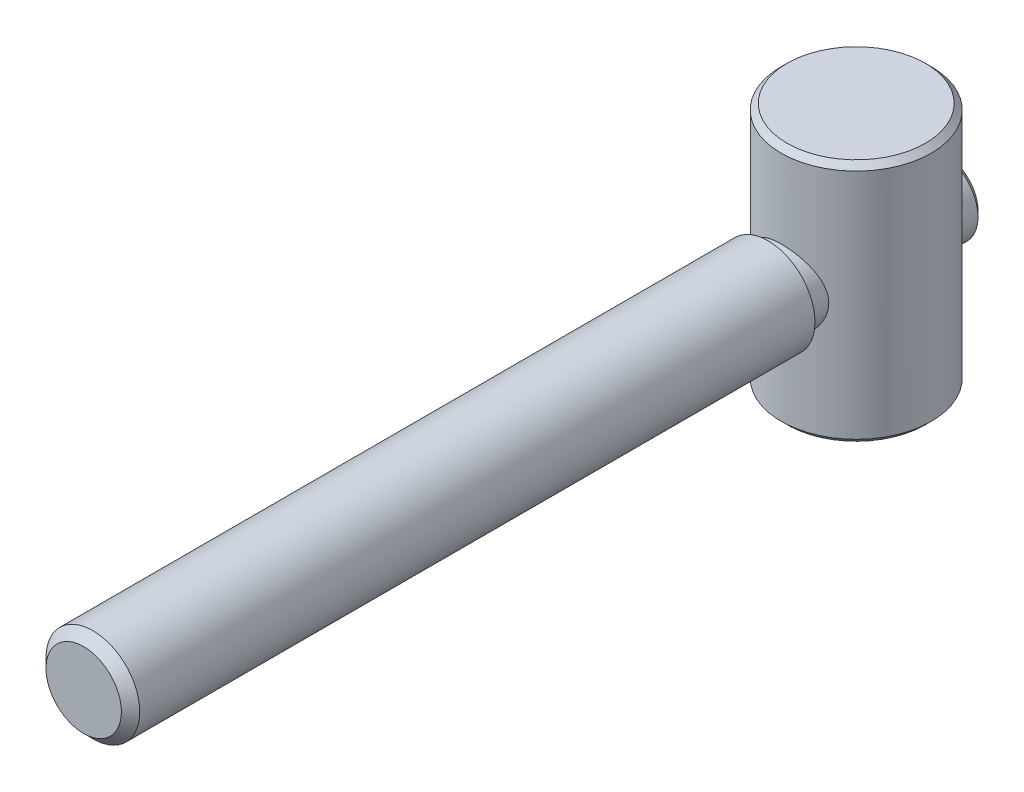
ISO-10303-21;
HEADER;
FILE_DESCRIPTION(('STEP AP214'),'2;1');
FILE_NAME('part.step','',(''),(''),'','','');
FILE_SCHEMA(('AUTOMOTIVE_DESIGN { 1 0 10303 214 1 1 1 1 }'));
ENDSEC;
DATA;
#1=APPLICATION_CONTEXT('core data for automotive mechanical design processes');
#2=APPLICATION_PROTOCOL_DEFINITION('international standard','automotive_design',2000,#1);
#3=PRODUCT_CONTEXT('',#1,'mechanical');
#4=PRODUCT('Part','Part','',(#3));
#5=PRODUCT_RELATED_PRODUCT_CATEGORY('part','',(#4));
#6=PRODUCT_DEFINITION_FORMATION('','',#4);
#7=PRODUCT_DEFINITION_CONTEXT('part definition',#1,'design');
#8=PRODUCT_DEFINITION('design','',#6,#7);
#9=PRODUCT_DEFINITION_SHAPE('','',#8);
#10=(LENGTH_UNIT() NAMED_UNIT(*) SI_UNIT(.MILLI.,.METRE.));
#11=(NAMED_UNIT(*) PLANE_ANGLE_UNIT() SI_UNIT($,.RADIAN.));
#12=(NAMED_UNIT(*) SI_UNIT($,.STERADIAN.) SOLID_ANGLE_UNIT());
#13=UNCERTAINTY_MEASURE_WITH_UNIT(LENGTH_MEASURE(1.E-05),#10,'distance_accuracy_value','');
#14=(GEOMETRIC_REPRESENTATION_CONTEXT(3) GLOBAL_UNCERTAINTY_ASSIGNED_CONTEXT((#13)) GLOBAL_UNIT_ASSIGNED_CONTEXT((#10,
#11,#12)) REPRESENTATION_CONTEXT('',''));
#15=CARTESIAN_POINT('',(0.,0.,0.));
#16=DIRECTION('',(0.,0.,1.));
#17=DIRECTION('',(1.,0.,0.));
#18=AXIS2_PLACEMENT_3D('',#15,#16,#17);
#19=CARTESIAN_POINT('',(-0.4,0.,-46.2));
#20=DIRECTION('',(1.,0.,0.));
#21=DIRECTION('',(0.,-1.,0.));
#22=AXIS2_PLACEMENT_3D('',#19,#20,#21);
#23=CYLINDRICAL_SURFACE('',#22,31.5);
#24=CARTESIAN_POINT('',(-0.4,0.,-46.2));
#25=DIRECTION('',(-1.,0.,0.));
#26=DIRECTION('',(0.,1.,0.));
#27=AXIS2_PLACEMENT_3D('',#24,#25,#26);
#28=CIRCLE('',#27,31.5);
#29=CARTESIAN_POINT('',(-0.4,-1.95959179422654,-14.7610114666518));
#30=VERTEX_POINT('',#29);
#31=CARTESIAN_POINT('',(-0.4,1.95959179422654,-14.7610114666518));
#32=VERTEX_POINT('',#31);
#33=EDGE_CURVE('E118',#30,#32,#28,.T.);
#34=ORIENTED_EDGE('',*,*,#33,.T.);
#35=CARTESIAN_POINT('',(-0.4,1.95959179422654,-14.7610114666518));
#36=CARTESIAN_POINT('',(-0.344561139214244,1.97091486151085,-14.7617184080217));
#37=CARTESIAN_POINT('',(-0.28863792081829,1.97987306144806,-14.762281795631));
#38=CARTESIAN_POINT('',(-0.176213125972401,1.99302430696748,-14.7631121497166));
#39=CARTESIAN_POINT('',(-0.119711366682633,1.99721579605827,-14.7633790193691));
#40=CARTESIAN_POINT('',(-0.00749894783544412,2.0007609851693,-14.7636046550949));
#41=CARTESIAN_POINT('',(0.0482092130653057,2.00019410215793,-14.7635684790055));
#42=CARTESIAN_POINT('',(0.159360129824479,1.99441663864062,-14.7632012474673));
#43=CARTESIAN_POINT('',(0.214802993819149,1.98920814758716,-14.7628703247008));
#44=CARTESIAN_POINT('',(0.313516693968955,1.97576492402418,-14.762023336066));
#45=CARTESIAN_POINT('',(0.356906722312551,1.96839158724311,-14.761560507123));
#46=CARTESIAN_POINT('',(0.4,1.95959179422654,-14.7610114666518));
#47=B_SPLINE_CURVE_WITH_KNOTS('',3,(#35,#36,#37,#38,#39,#40,#41,#42,#43,#44,#45,#46),
.UNSPECIFIED.,.F.,.F.,(4,2,2,2,2,4),(0.,0.169712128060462,0.33947965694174,0.506419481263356,
0.673284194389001,0.805229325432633),.UNSPECIFIED.);
#48=CARTESIAN_POINT('',(0.4,1.95959179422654,-14.7610114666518));
#49=VERTEX_POINT('',#48);
#50=EDGE_CURVE('E208',#32,#49,#47,.T.);
#51=ORIENTED_EDGE('',*,*,#50,.T.);
#52=CARTESIAN_POINT('',(0.4,0.,-46.2));
#53=DIRECTION('',(-1.,0.,0.));
#54=DIRECTION('',(0.,1.,0.));
#55=AXIS2_PLACEMENT_3D('',#52,#53,#54);
#56=CIRCLE('',#55,31.5);
#57=CARTESIAN_POINT('',(0.4,-1.95959179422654,-14.7610114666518));
#58=VERTEX_POINT('',#57);
#59=EDGE_CURVE('E105',#58,#49,#56,.T.);
#60=ORIENTED_EDGE('',*,*,#59,.F.);
#61=CARTESIAN_POINT('',(0.4,-1.95959179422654,-14.7610114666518));
#62=CARTESIAN_POINT('',(0.344561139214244,-1.97091486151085,-14.7617184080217));
#63=CARTESIAN_POINT('',(0.28863792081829,-1.97987306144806,-14.762281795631));
#64=CARTESIAN_POINT('',(0.176213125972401,-1.99302430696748,-14.7631121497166));
#65=CARTESIAN_POINT('',(0.119711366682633,-1.99721579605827,-14.7633790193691));
#66=CARTESIAN_POINT('',(0.00749894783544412,-2.0007609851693,-14.7636046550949));
#67=CARTESIAN_POINT('',(-0.0482092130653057,-2.00019410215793,-14.7635684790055));
#68=CARTESIAN_POINT('',(-0.159360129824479,-1.99441663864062,-14.7632012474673));
#69=CARTESIAN_POINT('',(-0.214802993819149,-1.98920814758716,-14.7628703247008));
#70=CARTESIAN_POINT('',(-0.313516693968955,-1.97576492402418,-14.762023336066));
#71=CARTESIAN_POINT('',(-0.356906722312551,-1.96839158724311,-14.761560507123));
#72=CARTESIAN_POINT('',(-0.4,-1.95959179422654,-14.7610114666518));
#73=B_SPLINE_CURVE_WITH_KNOTS('',3,(#61,#62,#63,#64,#65,#66,#67,#68,#69,#70,#71,#72),
.UNSPECIFIED.,.F.,.F.,(4,2,2,2,2,4),(0.,0.169712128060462,0.33947965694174,0.506419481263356,
0.673284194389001,0.805229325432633),.UNSPECIFIED.);
#74=EDGE_CURVE('E120',#58,#30,#73,.T.);
#75=ORIENTED_EDGE('',*,*,#74,.T.);
#76=EDGE_LOOP('',(#34,#51,#60,#75));
#77=FACE_BOUND('',#76,.T.);
#78=ADVANCED_FACE('F19',(#77),#23,.F.);
#79=CARTESIAN_POINT('',(0.,0.,-6.7));
#80=DIRECTION('',(0.,0.,1.));
#81=DIRECTION('',(1.,0.,0.));
#82=AXIS2_PLACEMENT_3D('',#79,#80,#81);
#83=CYLINDRICAL_SURFACE('',#82,2.);
#84=DIRECTION('',(0.,0.,1.));
#85=VECTOR('',#84,1.);
#86=CARTESIAN_POINT('',(0.4,-1.95959179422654,-16.2));
#87=LINE('',#86,#85);
#88=CARTESIAN_POINT('',(0.4,-1.95959179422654,-15.8935));
#89=VERTEX_POINT('',#88);
#90=CARTESIAN_POINT('',(0.4,-1.95959179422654,-15.3799497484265));
#91=VERTEX_POINT('',#90);
#92=EDGE_CURVE('E315',#89,#91,#87,.T.);
#93=ORIENTED_EDGE('',*,*,#92,.F.);
#94=CARTESIAN_POINT('',(0.,0.,-15.8935));
#95=DIRECTION('',(0.,0.,1.));
#96=DIRECTION('',(1.,0.,0.));
#97=AXIS2_PLACEMENT_3D('',#94,#95,#96);
#98=CIRCLE('',#97,2.);
#99=CARTESIAN_POINT('',(0.4,1.95959179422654,-15.8935));
#100=VERTEX_POINT('',#99);
#101=EDGE_CURVE('E589',#89,#100,#98,.T.);
#102=ORIENTED_EDGE('',*,*,#101,.T.);
#103=DIRECTION('',(0.,0.,1.));
#104=VECTOR('',#103,1.);
#105=CARTESIAN_POINT('',(0.4,1.95959179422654,-16.2));
#106=LINE('',#105,#104);
#107=CARTESIAN_POINT('',(0.4,1.95959179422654,-15.3799497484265));
#108=VERTEX_POINT('',#107);
#109=EDGE_CURVE('E313',#100,#108,#106,.T.);
#110=ORIENTED_EDGE('',*,*,#109,.T.);
#111=CARTESIAN_POINT('',(2.,0.,-14.8641016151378));
#112=CARTESIAN_POINT('',(1.99999158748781,0.104213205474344,-14.8641118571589));
#113=CARTESIAN_POINT('',(1.99179963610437,0.208562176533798,-14.8688763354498));
#114=CARTESIAN_POINT('',(1.95944672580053,0.414055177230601,-14.8872470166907));
#115=CARTESIAN_POINT('',(1.93525221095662,0.515192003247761,-14.9008717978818));
#116=CARTESIAN_POINT('',(1.8721998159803,0.710903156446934,-14.9349870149));
#117=CARTESIAN_POINT('',(1.83341988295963,0.80550925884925,-14.9554408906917));
#118=CARTESIAN_POINT('',(1.74253507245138,0.986848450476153,-15.0008532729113));
#119=CARTESIAN_POINT('',(1.69042947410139,1.07358111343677,-15.0258120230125));
#120=CARTESIAN_POINT('',(1.569333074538,1.24461144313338,-15.0799373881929));
#121=CARTESIAN_POINT('',(1.49930407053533,1.32811826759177,-15.109281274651));
#122=CARTESIAN_POINT('',(1.34650761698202,1.4828167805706,-15.1674396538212));
#123=CARTESIAN_POINT('',(1.26373385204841,1.55400232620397,-15.1962538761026));
#124=CARTESIAN_POINT('',(1.08097912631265,1.6867343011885,-15.2524295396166));
#125=CARTESIAN_POINT('',(0.980214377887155,1.74730753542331,-15.2795621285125));
#126=CARTESIAN_POINT('',(0.768314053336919,1.85028170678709,-15.3270151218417));
#127=CARTESIAN_POINT('',(0.657185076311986,1.8926941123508,-15.3473398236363));
#128=CARTESIAN_POINT('',(0.436089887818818,1.95500932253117,-15.3776092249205));
#129=CARTESIAN_POINT('',(0.326603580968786,1.9762990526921,-15.3881896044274));
#130=CARTESIAN_POINT('',(0.105141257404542,2.00033223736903,-15.4001516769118));
#131=CARTESIAN_POINT('',(-0.00683321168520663,2.00308691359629,-15.4015389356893));
#132=CARTESIAN_POINT('',(-0.219665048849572,1.99050665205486,-15.3952596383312));
#133=CARTESIAN_POINT('',(-0.320642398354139,1.97672396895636,-15.3883699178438));
#134=CARTESIAN_POINT('',(-0.518627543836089,1.93423831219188,-15.3674849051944));
#135=CARTESIAN_POINT('',(-0.615635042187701,1.90553422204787,-15.3534890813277));
#136=CARTESIAN_POINT('',(-0.804618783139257,1.83383486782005,-15.3194316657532));
#137=CARTESIAN_POINT('',(-0.896506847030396,1.79064737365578,-15.299288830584));
#138=CARTESIAN_POINT('',(-1.07195360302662,1.6914731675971,-15.2547529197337));
#139=CARTESIAN_POINT('',(-1.15550929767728,1.63548187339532,-15.2303583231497));
#140=CARTESIAN_POINT('',(-1.3203473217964,1.50620929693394,-15.1768878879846));
#141=CARTESIAN_POINT('',(-1.40066815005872,1.43179394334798,-15.1475875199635));
#142=CARTESIAN_POINT('',(-1.54820874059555,1.27082055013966,-15.0890868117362));
#143=CARTESIAN_POINT('',(-1.61541842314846,1.18425325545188,-15.0598865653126));
#144=CARTESIAN_POINT('',(-1.73901066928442,0.994703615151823,-15.0028831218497));
#145=CARTESIAN_POINT('',(-1.7944346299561,0.89102795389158,-14.9752863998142));
#146=CARTESIAN_POINT('',(-1.88663822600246,0.674124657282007,-14.9275090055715));
#147=CARTESIAN_POINT('',(-1.92343731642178,0.560907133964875,-14.9073206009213));
#148=CARTESIAN_POINT('',(-1.97436042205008,0.337570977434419,-14.8788927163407));
#149=CARTESIAN_POINT('',(-1.99005024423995,0.227917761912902,-14.8698331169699));
#150=CARTESIAN_POINT('',(-2.00303389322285,0.00719731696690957,-14.8623583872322));
#151=CARTESIAN_POINT('',(-2.00034071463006,-0.103868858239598,-14.8639357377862));
#152=CARTESIAN_POINT('',(-1.97807208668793,-0.311307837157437,-14.8766867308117));
#153=CARTESIAN_POINT('',(-1.96037563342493,-0.407958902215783,-14.8867917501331));
#154=CARTESIAN_POINT('',(-1.91139256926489,-0.596735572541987,-14.9138804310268));
#155=CARTESIAN_POINT('',(-1.88010155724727,-0.688859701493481,-14.9308663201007));
#156=CARTESIAN_POINT('',(-1.80329517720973,-0.870822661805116,-14.9707244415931));
#157=CARTESIAN_POINT('',(-1.7571881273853,-0.960358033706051,-14.9938328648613));
#158=CARTESIAN_POINT('',(-1.65257412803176,-1.13093854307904,-15.043122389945));
#159=CARTESIAN_POINT('',(-1.59406080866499,-1.21197928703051,-15.069305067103));
#160=CARTESIAN_POINT('',(-1.45767433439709,-1.37395753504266,-15.1257599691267));
#161=CARTESIAN_POINT('',(-1.37829054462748,-1.45359430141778,-15.1561316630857));
#162=CARTESIAN_POINT('',(-1.20680899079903,-1.59882447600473,-15.214684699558));
#163=CARTESIAN_POINT('',(-1.11470694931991,-1.66441314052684,-15.2428653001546));
#164=CARTESIAN_POINT('',(-0.917070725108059,-1.78114745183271,-15.2948272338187));
#165=CARTESIAN_POINT('',(-0.811246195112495,-1.83186623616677,-15.3184728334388));
#166=CARTESIAN_POINT('',(-0.591044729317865,-1.91427580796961,-15.3576670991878));
#167=CARTESIAN_POINT('',(-0.476675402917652,-1.9459833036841,-15.373222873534));
#168=CARTESIAN_POINT('',(-0.253959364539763,-1.98673712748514,-15.3933501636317));
#169=CARTESIAN_POINT('',(-0.1460228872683,-1.99759574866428,-15.3987985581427));
#170=CARTESIAN_POINT('',(0.0702519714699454,-2.00168653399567,-15.4008426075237));
#171=CARTESIAN_POINT('',(0.178590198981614,-1.99492486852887,-15.3974413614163));
#172=CARTESIAN_POINT('',(0.385075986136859,-1.96516717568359,-15.3826793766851));
#173=CARTESIAN_POINT('',(0.483424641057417,-1.94327026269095,-15.3718578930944));
#174=CARTESIAN_POINT('',(0.674891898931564,-1.88534604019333,-15.3438418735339));
#175=CARTESIAN_POINT('',(0.768009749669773,-1.84931670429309,-15.3266464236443));
#176=CARTESIAN_POINT('',(0.95084683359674,-1.7625457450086,-15.2865186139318));
#177=CARTESIAN_POINT('',(1.04025036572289,-1.71124078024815,-15.263372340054));
#178=CARTESIAN_POINT('',(1.20954920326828,-1.59608471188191,-15.2137626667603));
#179=CARTESIAN_POINT('',(1.28944011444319,-1.53222784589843,-15.1872977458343));
#180=CARTESIAN_POINT('',(1.44582833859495,-1.38640336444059,-15.1305721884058));
#181=CARTESIAN_POINT('',(1.52119665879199,-1.30326581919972,-15.1001959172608));
#182=CARTESIAN_POINT('',(1.65732528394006,-1.12510777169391,-15.0412615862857));
#183=CARTESIAN_POINT('',(1.71807266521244,-1.03007686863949,-15.0127051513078));
#184=CARTESIAN_POINT('',(1.82486714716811,-0.826691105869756,-14.9599918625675));
#185=CARTESIAN_POINT('',(1.87038902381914,-0.718010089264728,-14.9360025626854));
#186=CARTESIAN_POINT('',(1.92395929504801,-0.549421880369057,-14.9069621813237));
#187=CARTESIAN_POINT('',(1.93935666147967,-0.492352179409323,-14.898443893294));
#188=CARTESIAN_POINT('',(1.96508069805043,-0.376767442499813,-14.8840605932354));
#189=CARTESIAN_POINT('',(1.97541091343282,-0.318253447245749,-14.8781937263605));
#190=CARTESIAN_POINT('',(1.9887293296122,-0.21639921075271,-14.8705902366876));
#191=CARTESIAN_POINT('',(1.99295091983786,-0.173266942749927,-14.8681638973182));
#192=CARTESIAN_POINT('',(1.99858810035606,-0.0867643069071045,-14.8649174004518));
#193=CARTESIAN_POINT('',(2.00000350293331,-0.0433939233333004,-14.8640973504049));
#194=CARTESIAN_POINT('',(2.,0.,-14.8641016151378));
#195=B_SPLINE_CURVE_WITH_KNOTS('',3,(#111,#112,#113,#114,#115,#116,#117,#118,#119,#120,#121,
#122,#123,#124,#125,#126,#127,#128,#129,#130,#131,#132,#133,#134,#135,#136,#137,#138,#139,#140,
#141,#142,#143,#144,#145,#146,#147,#148,#149,#150,#151,#152,#153,#154,#155,#156,#157,#158,#159,
#160,#161,#162,#163,#164,#165,#166,#167,#168,#169,#170,#171,#172,#173,#174,#175,#176,#177,#178,
#179,#180,#181,#182,#183,#184,#185,#186,#187,#188,#189,#190,#191,#192,#193,#194),.UNSPECIFIED.,
.T.,.F.,(4,2,2,2,2,2,2,2,2,2,2,2,2,2,2,2,2,2,2,2,2,2,2,2,2,2,2,2,2,2,2,2,2,2,2,2,2,2,2,2,2,4),
(0.,0.312464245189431,0.625585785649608,0.937057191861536,1.24854545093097,1.58572462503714,
1.92307142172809,2.28315784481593,2.64301653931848,2.97726969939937,3.31132047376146,
3.61632194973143,3.92134625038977,4.2305906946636,4.5399459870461,4.87854382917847,
5.21740096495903,5.57777683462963,5.93777548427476,6.2692458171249,6.60048186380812,
6.89548366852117,7.19058104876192,7.49934592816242,7.80826972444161,8.15613487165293,
8.50411729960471,8.86128362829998,9.21813559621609,9.5422454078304,9.8662417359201,
10.1688884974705,10.4715786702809,10.7872150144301,11.102996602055,11.450204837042,
11.7977188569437,12.1562149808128,12.3351395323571,12.5139387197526,12.6440387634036,
12.7741475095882),.UNSPECIFIED.);
#196=EDGE_CURVE('E113',#91,#108,#195,.T.);
#197=ORIENTED_EDGE('',*,*,#196,.F.);
#198=EDGE_LOOP('',(#93,#102,#110,#197));
#199=FACE_BOUND('',#198,.T.);
#200=ADVANCED_FACE('F222',(#199),#83,.T.);
#201=CARTESIAN_POINT('',(0.4,0.,-46.2));
#202=DIRECTION('',(-1.,0.,0.));
#203=DIRECTION('',(0.,1.,0.));
#204=AXIS2_PLACEMENT_3D('',#201,#202,#203);
#205=PLANE('',#204);
#206=DIRECTION('',(0.,1.,0.));
#207=VECTOR('',#206,1.);
#208=CARTESIAN_POINT('',(0.4,1.95959179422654,-16.2));
#209=LINE('',#208,#207);
#210=CARTESIAN_POINT('',(0.4,-1.64558264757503,-16.2));
#211=VERTEX_POINT('',#210);
#212=CARTESIAN_POINT('',(0.4,1.64558264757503,-16.2));
#213=VERTEX_POINT('',#212);
#214=EDGE_CURVE('E309',#211,#213,#209,.T.);
#215=ORIENTED_EDGE('',*,*,#214,.F.);
#216=CARTESIAN_POINT('',(0.4,-1.64558264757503,-16.2));
#217=CARTESIAN_POINT('',(0.4,-1.69802260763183,-16.149024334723));
#218=CARTESIAN_POINT('',(0.4,-1.75041001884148,-16.0979948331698));
#219=CARTESIAN_POINT('',(0.4,-1.85507973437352,-15.9958281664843));
#220=CARTESIAN_POINT('',(0.4,-1.90736203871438,-15.9446910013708));
#221=CARTESIAN_POINT('',(0.4,-1.95959179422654,-15.8935));
#222=B_SPLINE_CURVE_WITH_KNOTS('',3,(#216,#217,#218,#219,#220,#221),.UNSPECIFIED.,.F.,.F.,(4,2,
4),(0.,0.219399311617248,0.438798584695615),.UNSPECIFIED.);
#223=EDGE_CURVE('E249',#211,#89,#222,.T.);
#224=ORIENTED_EDGE('',*,*,#223,.T.);
#225=ORIENTED_EDGE('',*,*,#92,.T.);
#226=DIRECTION('',(0.,0.,1.));
#227=VECTOR('',#226,1.);
#228=CARTESIAN_POINT('',(0.4,-1.95959179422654,-6.7));
#229=LINE('',#228,#227);
#230=EDGE_CURVE('E101',#91,#58,#229,.T.);
#231=ORIENTED_EDGE('',*,*,#230,.T.);
#232=ORIENTED_EDGE('',*,*,#59,.T.);
#233=DIRECTION('',(0.,0.,1.));
#234=VECTOR('',#233,1.);
#235=CARTESIAN_POINT('',(0.4,1.95959179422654,-6.7));
#236=LINE('',#235,#234);
#237=EDGE_CURVE('E197',#49,#108,#236,.F.);
#238=ORIENTED_EDGE('',*,*,#237,.T.);
#239=ORIENTED_EDGE('',*,*,#109,.F.);
#240=CARTESIAN_POINT('',(0.4,1.95959179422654,-15.8935));
#241=CARTESIAN_POINT('',(0.4,1.90736203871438,-15.9446910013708));
#242=CARTESIAN_POINT('',(0.4,1.85507973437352,-15.9958281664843));
#243=CARTESIAN_POINT('',(0.4,1.75041001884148,-16.0979948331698));
#244=CARTESIAN_POINT('',(0.4,1.69802260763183,-16.149024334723));
#245=CARTESIAN_POINT('',(0.4,1.64558264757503,-16.2));
#246=B_SPLINE_CURVE_WITH_KNOTS('',3,(#240,#241,#242,#243,#244,#245),.UNSPECIFIED.,.F.,.F.,(4,2,
4),(0.,0.219399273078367,0.438798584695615),.UNSPECIFIED.);
#247=EDGE_CURVE('E242',#100,#213,#246,.T.);
#248=ORIENTED_EDGE('',*,*,#247,.T.);
#249=EDGE_LOOP('',(#215,#224,#225,#231,#232,#238,#239,#248));
#250=FACE_BOUND('',#249,.T.);
#251=ADVANCED_FACE('F224',(#250),#205,.T.);
#252=DIRECTION('',(0.,0.,1.));
#253=VECTOR('',#252,1.);
#254=CARTESIAN_POINT('',(-0.4,1.95959179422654,-16.2));
#255=LINE('',#254,#253);
#256=CARTESIAN_POINT('',(-0.4,1.95959179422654,-15.8935));
#257=VERTEX_POINT('',#256);
#258=CARTESIAN_POINT('',(-0.4,1.95959179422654,-15.3799497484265));
#259=VERTEX_POINT('',#258);
#260=EDGE_CURVE('E89',#257,#259,#255,.T.);
#261=ORIENTED_EDGE('',*,*,#260,.F.);
#262=CARTESIAN_POINT('',(0.,0.,-15.8935));
#263=DIRECTION('',(0.,0.,1.));
#264=DIRECTION('',(1.,0.,0.));
#265=AXIS2_PLACEMENT_3D('',#262,#263,#264);
#266=CIRCLE('',#265,2.);
#267=CARTESIAN_POINT('',(-0.4,-1.95959179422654,-15.8935));
#268=VERTEX_POINT('',#267);
#269=EDGE_CURVE('E11',#257,#268,#266,.T.);
#270=ORIENTED_EDGE('',*,*,#269,.T.);
#271=DIRECTION('',(0.,0.,1.));
#272=VECTOR('',#271,1.);
#273=CARTESIAN_POINT('',(-0.4,-1.95959179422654,-16.2));
#274=LINE('',#273,#272);
#275=CARTESIAN_POINT('',(-0.4,-1.95959179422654,-15.3799497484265));
#276=VERTEX_POINT('',#275);
#277=EDGE_CURVE('E81',#268,#276,#274,.T.);
#278=ORIENTED_EDGE('',*,*,#277,.T.);
#279=EDGE_CURVE('E85',#259,#276,#195,.T.);
#280=ORIENTED_EDGE('',*,*,#279,.F.);
#281=EDGE_LOOP('',(#261,#270,#278,#280));
#282=FACE_BOUND('',#281,.T.);
#283=ADVANCED_FACE('F83',(#282),#83,.T.);
#284=CARTESIAN_POINT('',(-0.4,0.,-46.2));
#285=DIRECTION('',(-1.,0.,0.));
#286=DIRECTION('',(0.,1.,0.));
#287=AXIS2_PLACEMENT_3D('',#284,#285,#286);
#288=PLANE('',#287);
#289=DIRECTION('',(0.,-1.,0.));
#290=VECTOR('',#289,1.);
#291=CARTESIAN_POINT('',(-0.4,-1.95959179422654,-16.2));
#292=LINE('',#291,#290);
#293=CARTESIAN_POINT('',(-0.4,1.64558264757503,-16.2));
#294=VERTEX_POINT('',#293);
#295=CARTESIAN_POINT('',(-0.4,-1.64558264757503,-16.2));
#296=VERTEX_POINT('',#295);
#297=EDGE_CURVE('E90',#294,#296,#292,.T.);
#298=ORIENTED_EDGE('',*,*,#297,.F.);
#299=CARTESIAN_POINT('',(-0.4,1.64558264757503,-16.2));
#300=CARTESIAN_POINT('',(-0.4,1.69802260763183,-16.149024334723));
#301=CARTESIAN_POINT('',(-0.4,1.75041001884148,-16.0979948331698));
#302=CARTESIAN_POINT('',(-0.4,1.85507973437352,-15.9958281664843));
#303=CARTESIAN_POINT('',(-0.4,1.90736203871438,-15.9446910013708));
#304=CARTESIAN_POINT('',(-0.4,1.95959179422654,-15.8935));
#305=B_SPLINE_CURVE_WITH_KNOTS('',3,(#299,#300,#301,#302,#303,#304),.UNSPECIFIED.,.F.,.F.,(4,2,
4),(0.,0.219399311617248,0.438798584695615),.UNSPECIFIED.);
#306=EDGE_CURVE('E29',#294,#257,#305,.T.);
#307=ORIENTED_EDGE('',*,*,#306,.T.);
#308=ORIENTED_EDGE('',*,*,#260,.T.);
#309=DIRECTION('',(0.,0.,1.));
#310=VECTOR('',#309,1.);
#311=CARTESIAN_POINT('',(-0.4,1.95959179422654,-6.7));
#312=LINE('',#311,#310);
#313=EDGE_CURVE('E164',#32,#259,#312,.F.);
#314=ORIENTED_EDGE('',*,*,#313,.F.);
#315=ORIENTED_EDGE('',*,*,#33,.F.);
#316=DIRECTION('',(0.,0.,1.));
#317=VECTOR('',#316,1.);
#318=CARTESIAN_POINT('',(-0.4,-1.95959179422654,-6.7));
#319=LINE('',#318,#317);
#320=EDGE_CURVE('E99',#276,#30,#319,.T.);
#321=ORIENTED_EDGE('',*,*,#320,.F.);
#322=ORIENTED_EDGE('',*,*,#277,.F.);
#323=CARTESIAN_POINT('',(-0.4,-1.95959179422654,-15.8935));
#324=CARTESIAN_POINT('',(-0.4,-1.90736203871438,-15.9446910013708));
#325=CARTESIAN_POINT('',(-0.4,-1.85507973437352,-15.9958281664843));
#326=CARTESIAN_POINT('',(-0.4,-1.75041001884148,-16.0979948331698));
#327=CARTESIAN_POINT('',(-0.4,-1.69802260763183,-16.149024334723));
#328=CARTESIAN_POINT('',(-0.4,-1.64558264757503,-16.2));
#329=B_SPLINE_CURVE_WITH_KNOTS('',3,(#323,#324,#325,#326,#327,#328),.UNSPECIFIED.,.F.,.F.,(4,2,
4),(0.,0.219399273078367,0.438798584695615),.UNSPECIFIED.);
#330=EDGE_CURVE('E576',#268,#296,#329,.T.);
#331=ORIENTED_EDGE('',*,*,#330,.T.);
#332=EDGE_LOOP('',(#298,#307,#308,#314,#315,#321,#322,#331));
#333=FACE_BOUND('',#332,.T.);
#334=ADVANCED_FACE('F115',(#333),#288,.F.);
#335=CARTESIAN_POINT('',(0.,-6.5,-11.4));
#336=DIRECTION('',(0.,-1.,0.));
#337=DIRECTION('',(-1.,0.,0.));
#338=AXIS2_PLACEMENT_3D('',#335,#336,#337);
#339=PLANE('',#338);
#340=CARTESIAN_POINT('',(0.,-6.5,-11.4));
#341=DIRECTION('',(0.,-1.,0.));
#342=DIRECTION('',(0.,0.,-1.));
#343=AXIS2_PLACEMENT_3D('',#340,#341,#342);
#344=CIRCLE('',#343,3.6935);
#345=CARTESIAN_POINT('',(0.,-6.5,-15.0935));
#346=VERTEX_POINT('',#345);
#347=EDGE_CURVE('E294',#346,#346,#344,.T.);
#348=ORIENTED_EDGE('',*,*,#347,.T.);
#349=EDGE_LOOP('',(#348));
#350=FACE_BOUND('',#349,.T.);
#351=ADVANCED_FACE('F343',(#350),#339,.T.);
#352=CARTESIAN_POINT('',(0.,6.5,-11.4));
#353=DIRECTION('',(0.,1.,0.));
#354=DIRECTION('',(1.,0.,0.));
#355=AXIS2_PLACEMENT_3D('',#352,#353,#354);
#356=PLANE('',#355);
#357=CARTESIAN_POINT('',(0.,6.5,-11.4));
#358=DIRECTION('',(0.,1.,0.));
#359=DIRECTION('',(0.,0.,1.));
#360=AXIS2_PLACEMENT_3D('',#357,#358,#359);
#361=CIRCLE('',#360,3.6935);
#362=CARTESIAN_POINT('',(0.,6.5,-7.7065));
#363=VERTEX_POINT('',#362);
#364=EDGE_CURVE('E285',#363,#363,#361,.T.);
#365=ORIENTED_EDGE('',*,*,#364,.T.);
#366=EDGE_LOOP('',(#365));
#367=FACE_BOUND('',#366,.T.);
#368=ADVANCED_FACE('F341',(#367),#356,.T.);
#369=CARTESIAN_POINT('',(0.,6.5,-11.4));
#370=DIRECTION('',(0.,1.,0.));
#371=DIRECTION('',(1.,0.,0.));
#372=AXIS2_PLACEMENT_3D('',#369,#370,#371);
#373=CYLINDRICAL_SURFACE('',#372,4.);
#374=CARTESIAN_POINT('',(0.,-6.1935,-11.4));
#375=DIRECTION('',(0.,-1.,0.));
#376=DIRECTION('',(0.,0.,-1.));
#377=AXIS2_PLACEMENT_3D('',#374,#375,#376);
#378=CIRCLE('',#377,4.);
#379=CARTESIAN_POINT('',(0.,-6.1935,-15.4));
#380=VERTEX_POINT('',#379);
#381=EDGE_CURVE('E290',#380,#380,#378,.F.);
#382=ORIENTED_EDGE('',*,*,#381,.T.);
#383=EDGE_LOOP('',(#382));
#384=FACE_BOUND('',#383,.T.);
#385=CARTESIAN_POINT('',(0.,6.1935,-11.4));
#386=DIRECTION('',(0.,1.,0.));
#387=DIRECTION('',(0.,0.,1.));
#388=AXIS2_PLACEMENT_3D('',#385,#386,#387);
#389=CIRCLE('',#388,4.);
#390=CARTESIAN_POINT('',(0.,6.1935,-7.4));
#391=VERTEX_POINT('',#390);
#392=EDGE_CURVE('E288',#391,#391,#389,.F.);
#393=ORIENTED_EDGE('',*,*,#392,.T.);
#394=EDGE_LOOP('',(#393));
#395=FACE_BOUND('',#394,.T.);
#396=CARTESIAN_POINT('',(2.,0.,-7.93589838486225));
#397=CARTESIAN_POINT('',(1.99999158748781,-0.104213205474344,-7.93588814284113));
#398=CARTESIAN_POINT('',(1.99179963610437,-0.208562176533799,-7.93112366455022));
#399=CARTESIAN_POINT('',(1.95944672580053,-0.414055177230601,-7.91275298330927));
#400=CARTESIAN_POINT('',(1.93525221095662,-0.515192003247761,-7.89912820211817));
#401=CARTESIAN_POINT('',(1.8721998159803,-0.710903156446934,-7.86501298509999));
#402=CARTESIAN_POINT('',(1.83341988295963,-0.80550925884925,-7.84455910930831));
#403=CARTESIAN_POINT('',(1.74253507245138,-0.986848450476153,-7.79914672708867));
#404=CARTESIAN_POINT('',(1.69042947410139,-1.07358111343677,-7.77418797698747));
#405=CARTESIAN_POINT('',(1.569333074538,-1.24461144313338,-7.72006261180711));
#406=CARTESIAN_POINT('',(1.49930407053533,-1.32811826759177,-7.69071872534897));
#407=CARTESIAN_POINT('',(1.34650761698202,-1.4828167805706,-7.63256034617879));
#408=CARTESIAN_POINT('',(1.26373385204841,-1.55400232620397,-7.60374612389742));
#409=CARTESIAN_POINT('',(1.08097912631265,-1.6867343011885,-7.5475704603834));
#410=CARTESIAN_POINT('',(0.980214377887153,-1.74730753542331,-7.52043787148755));
#411=CARTESIAN_POINT('',(0.768314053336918,-1.85028170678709,-7.47298487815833));
#412=CARTESIAN_POINT('',(0.657185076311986,-1.8926941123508,-7.45266017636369));
#413=CARTESIAN_POINT('',(0.436089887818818,-1.95500932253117,-7.42239077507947));
#414=CARTESIAN_POINT('',(0.326603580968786,-1.9762990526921,-7.4118103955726));
#415=CARTESIAN_POINT('',(0.105141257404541,-2.00033223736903,-7.39984832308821));
#416=CARTESIAN_POINT('',(-0.00683321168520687,-2.00308691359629,-7.39846106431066));
#417=CARTESIAN_POINT('',(-0.219665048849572,-1.99050665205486,-7.40474036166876));
#418=CARTESIAN_POINT('',(-0.320642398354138,-1.97672396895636,-7.41163008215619));
#419=CARTESIAN_POINT('',(-0.518627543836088,-1.93423831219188,-7.43251509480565));
#420=CARTESIAN_POINT('',(-0.6156350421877,-1.90553422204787,-7.44651091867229));
#421=CARTESIAN_POINT('',(-0.804618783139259,-1.83383486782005,-7.48056833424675));
#422=CARTESIAN_POINT('',(-0.896506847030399,-1.79064737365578,-7.50071116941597));
#423=CARTESIAN_POINT('',(-1.07195360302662,-1.6914731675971,-7.5452470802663));
#424=CARTESIAN_POINT('',(-1.15550929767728,-1.63548187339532,-7.56964167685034));
#425=CARTESIAN_POINT('',(-1.3203473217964,-1.50620929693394,-7.62311211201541));
#426=CARTESIAN_POINT('',(-1.40066815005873,-1.43179394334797,-7.6524124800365));
#427=CARTESIAN_POINT('',(-1.54820874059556,-1.27082055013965,-7.71091318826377));
#428=CARTESIAN_POINT('',(-1.61541842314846,-1.18425325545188,-7.74011343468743));
#429=CARTESIAN_POINT('',(-1.73901066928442,-0.994703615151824,-7.79711687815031));
#430=CARTESIAN_POINT('',(-1.7944346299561,-0.891027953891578,-7.82471360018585));
#431=CARTESIAN_POINT('',(-1.88663822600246,-0.674124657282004,-7.87249099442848));
#432=CARTESIAN_POINT('',(-1.92343731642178,-0.560907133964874,-7.89267939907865));
#433=CARTESIAN_POINT('',(-1.97436042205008,-0.33757097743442,-7.92110728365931));
#434=CARTESIAN_POINT('',(-1.99005024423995,-0.227917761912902,-7.93016688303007));
#435=CARTESIAN_POINT('',(-2.00303389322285,-0.00719731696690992,-7.93764161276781));
#436=CARTESIAN_POINT('',(-2.00034071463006,0.103868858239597,-7.93606426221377));
#437=CARTESIAN_POINT('',(-1.97807208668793,0.311307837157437,-7.9233132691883));
#438=CARTESIAN_POINT('',(-1.96037563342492,0.407958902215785,-7.91320824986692));
#439=CARTESIAN_POINT('',(-1.91139256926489,0.596735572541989,-7.88611956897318));
#440=CARTESIAN_POINT('',(-1.88010155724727,0.688859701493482,-7.86913367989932));
#441=CARTESIAN_POINT('',(-1.80329517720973,0.870822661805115,-7.82927555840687));
#442=CARTESIAN_POINT('',(-1.7571881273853,0.960358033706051,-7.80616713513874));
#443=CARTESIAN_POINT('',(-1.65257412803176,1.13093854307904,-7.756877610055));
#444=CARTESIAN_POINT('',(-1.59406080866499,1.21197928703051,-7.73069493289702));
#445=CARTESIAN_POINT('',(-1.45767433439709,1.37395753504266,-7.67424003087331));
#446=CARTESIAN_POINT('',(-1.37829054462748,1.45359430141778,-7.64386833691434));
#447=CARTESIAN_POINT('',(-1.20680899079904,1.59882447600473,-7.58531530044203));
#448=CARTESIAN_POINT('',(-1.11470694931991,1.66441314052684,-7.55713469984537));
#449=CARTESIAN_POINT('',(-0.917070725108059,1.78114745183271,-7.50517276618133));
#450=CARTESIAN_POINT('',(-0.811246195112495,1.83186623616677,-7.48152716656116));
#451=CARTESIAN_POINT('',(-0.591044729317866,1.91427580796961,-7.44233290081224));
#452=CARTESIAN_POINT('',(-0.476675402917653,1.9459833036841,-7.42677712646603));
#453=CARTESIAN_POINT('',(-0.253959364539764,1.98673712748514,-7.40664983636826));
#454=CARTESIAN_POINT('',(-0.1460228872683,1.99759574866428,-7.4012014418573));
#455=CARTESIAN_POINT('',(0.0702519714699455,2.00168653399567,-7.39915739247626));
#456=CARTESIAN_POINT('',(0.178590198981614,1.99492486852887,-7.40255863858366));
#457=CARTESIAN_POINT('',(0.385075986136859,1.96516717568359,-7.41732062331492));
#458=CARTESIAN_POINT('',(0.483424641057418,1.94327026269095,-7.42814210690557));
#459=CARTESIAN_POINT('',(0.674891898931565,1.88534604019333,-7.45615812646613));
#460=CARTESIAN_POINT('',(0.768009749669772,1.84931670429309,-7.47335357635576));
#461=CARTESIAN_POINT('',(0.950846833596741,1.7625457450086,-7.51348138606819));
#462=CARTESIAN_POINT('',(1.0402503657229,1.71124078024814,-7.53662765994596));
#463=CARTESIAN_POINT('',(1.20954920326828,1.59608471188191,-7.58623733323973));
#464=CARTESIAN_POINT('',(1.28944011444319,1.53222784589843,-7.61270225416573));
#465=CARTESIAN_POINT('',(1.44582833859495,1.38640336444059,-7.66942781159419));
#466=CARTESIAN_POINT('',(1.52119665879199,1.30326581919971,-7.69980408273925));
#467=CARTESIAN_POINT('',(1.65732528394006,1.12510777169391,-7.75873841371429));
#468=CARTESIAN_POINT('',(1.71807266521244,1.03007686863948,-7.78729484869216));
#469=CARTESIAN_POINT('',(1.82486714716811,0.826691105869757,-7.84000813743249));
#470=CARTESIAN_POINT('',(1.87038902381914,0.718010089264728,-7.86399743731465));
#471=CARTESIAN_POINT('',(1.92395929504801,0.549421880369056,-7.8930378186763));
#472=CARTESIAN_POINT('',(1.93935666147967,0.492352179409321,-7.90155610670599));
#473=CARTESIAN_POINT('',(1.96508069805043,0.376767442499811,-7.91593940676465));
#474=CARTESIAN_POINT('',(1.97541091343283,0.318253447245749,-7.9218062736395));
#475=CARTESIAN_POINT('',(1.9887293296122,0.21639921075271,-7.92940976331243));
#476=CARTESIAN_POINT('',(1.99295091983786,0.173266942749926,-7.93183610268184));
#477=CARTESIAN_POINT('',(1.99858810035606,0.086764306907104,-7.93508259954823));
#478=CARTESIAN_POINT('',(2.00000350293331,0.0433939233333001,-7.93590264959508));
#479=CARTESIAN_POINT('',(2.,0.,-7.93589838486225));
#480=B_SPLINE_CURVE_WITH_KNOTS('',3,(#396,#397,#398,#399,#400,#401,#402,#403,#404,#405,#406,
#407,#408,#409,#410,#411,#412,#413,#414,#415,#416,#417,#418,#419,#420,#421,#422,#423,#424,#425,
#426,#427,#428,#429,#430,#431,#432,#433,#434,#435,#436,#437,#438,#439,#440,#441,#442,#443,#444,
#445,#446,#447,#448,#449,#450,#451,#452,#453,#454,#455,#456,#457,#458,#459,#460,#461,#462,#463,
#464,#465,#466,#467,#468,#469,#470,#471,#472,#473,#474,#475,#476,#477,#478,#479),.UNSPECIFIED.,
.T.,.F.,(4,2,2,2,2,2,2,2,2,2,2,2,2,2,2,2,2,2,2,2,2,2,2,2,2,2,2,2,2,2,2,2,2,2,2,2,2,2,2,2,2,4),
(0.,0.312464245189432,0.62558578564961,0.937057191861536,1.24854545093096,1.58572462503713,
1.92307142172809,2.28315784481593,2.64301653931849,2.97726969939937,3.31132047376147,
3.61632194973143,3.92134625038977,4.2305906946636,4.53994598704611,4.87854382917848,
5.21740096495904,5.57777683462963,5.93777548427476,6.2692458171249,6.60048186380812,
6.89548366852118,7.19058104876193,7.49934592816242,7.80826972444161,8.15613487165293,
8.50411729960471,8.86128362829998,9.2181355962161,9.5422454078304,9.8662417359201,
10.1688884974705,10.4715786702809,10.7872150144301,11.102996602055,11.450204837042,
11.7977188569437,12.1562149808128,12.3351395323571,12.5139387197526,12.6440387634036,
12.7741475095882),.UNSPECIFIED.);
#481=CARTESIAN_POINT('',(2.,0.,-7.93589838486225));
#482=VERTEX_POINT('',#481);
#483=EDGE_CURVE('E112',#482,#482,#480,.T.);
#484=ORIENTED_EDGE('',*,*,#483,.T.);
#485=EDGE_LOOP('',(#484));
#486=FACE_BOUND('',#485,.T.);
#487=CARTESIAN_POINT('',(-2.,0.,-14.8641016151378));
#488=CARTESIAN_POINT('',(-1.99999158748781,-0.104213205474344,-14.8641118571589));
#489=CARTESIAN_POINT('',(-1.99179963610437,-0.208562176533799,-14.8688763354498));
#490=CARTESIAN_POINT('',(-1.95944672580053,-0.414055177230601,-14.8872470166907));
#491=CARTESIAN_POINT('',(-1.93525221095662,-0.515192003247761,-14.9008717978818));
#492=CARTESIAN_POINT('',(-1.8721998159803,-0.710903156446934,-14.9349870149));
#493=CARTESIAN_POINT('',(-1.83341988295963,-0.80550925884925,-14.9554408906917));
#494=CARTESIAN_POINT('',(-1.74253507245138,-0.986848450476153,-15.0008532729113));
#495=CARTESIAN_POINT('',(-1.69042947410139,-1.07358111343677,-15.0258120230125));
#496=CARTESIAN_POINT('',(-1.569333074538,-1.24461144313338,-15.0799373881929));
#497=CARTESIAN_POINT('',(-1.49930407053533,-1.32811826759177,-15.109281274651));
#498=CARTESIAN_POINT('',(-1.34650761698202,-1.4828167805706,-15.1674396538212));
#499=CARTESIAN_POINT('',(-1.26373385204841,-1.55400232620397,-15.1962538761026));
#500=CARTESIAN_POINT('',(-1.08097912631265,-1.6867343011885,-15.2524295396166));
#501=CARTESIAN_POINT('',(-0.980214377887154,-1.74730753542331,-15.2795621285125));
#502=CARTESIAN_POINT('',(-0.768314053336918,-1.85028170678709,-15.3270151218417));
#503=CARTESIAN_POINT('',(-0.657185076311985,-1.8926941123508,-15.3473398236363));
#504=CARTESIAN_POINT('',(-0.436089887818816,-1.95500932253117,-15.3776092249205));
#505=CARTESIAN_POINT('',(-0.326603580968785,-1.9762990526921,-15.3881896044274));
#506=CARTESIAN_POINT('',(-0.105141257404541,-2.00033223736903,-15.4001516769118));
#507=CARTESIAN_POINT('',(0.0068332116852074,-2.00308691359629,-15.4015389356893));
#508=CARTESIAN_POINT('',(0.219665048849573,-1.99050665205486,-15.3952596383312));
#509=CARTESIAN_POINT('',(0.32064239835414,-1.97672396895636,-15.3883699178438));
#510=CARTESIAN_POINT('',(0.51862754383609,-1.93423831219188,-15.3674849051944));
#511=CARTESIAN_POINT('',(0.615635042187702,-1.90553422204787,-15.3534890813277));
#512=CARTESIAN_POINT('',(0.804618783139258,-1.83383486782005,-15.3194316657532));
#513=CARTESIAN_POINT('',(0.896506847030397,-1.79064737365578,-15.299288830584));
#514=CARTESIAN_POINT('',(1.07195360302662,-1.6914731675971,-15.2547529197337));
#515=CARTESIAN_POINT('',(1.15550929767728,-1.63548187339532,-15.2303583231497));
#516=CARTESIAN_POINT('',(1.3203473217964,-1.50620929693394,-15.1768878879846));
#517=CARTESIAN_POINT('',(1.40066815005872,-1.43179394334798,-15.1475875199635));
#518=CARTESIAN_POINT('',(1.54820874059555,-1.27082055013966,-15.0890868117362));
#519=CARTESIAN_POINT('',(1.61541842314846,-1.18425325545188,-15.0598865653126));
#520=CARTESIAN_POINT('',(1.73901066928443,-0.994703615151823,-15.0028831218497));
#521=CARTESIAN_POINT('',(1.7944346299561,-0.89102795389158,-14.9752863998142));
#522=CARTESIAN_POINT('',(1.88663822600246,-0.674124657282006,-14.9275090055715));
#523=CARTESIAN_POINT('',(1.92343731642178,-0.560907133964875,-14.9073206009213));
#524=CARTESIAN_POINT('',(1.97436042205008,-0.337570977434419,-14.8788927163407));
#525=CARTESIAN_POINT('',(1.99005024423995,-0.227917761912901,-14.8698331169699));
#526=CARTESIAN_POINT('',(2.00303389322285,-0.00719731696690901,-14.8623583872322));
#527=CARTESIAN_POINT('',(2.00034071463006,0.103868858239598,-14.8639357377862));
#528=CARTESIAN_POINT('',(1.97807208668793,0.311307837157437,-14.8766867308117));
#529=CARTESIAN_POINT('',(1.96037563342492,0.407958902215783,-14.8867917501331));
#530=CARTESIAN_POINT('',(1.91139256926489,0.596735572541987,-14.9138804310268));
#531=CARTESIAN_POINT('',(1.88010155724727,0.688859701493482,-14.9308663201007));
#532=CARTESIAN_POINT('',(1.80329517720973,0.870822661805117,-14.9707244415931));
#533=CARTESIAN_POINT('',(1.7571881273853,0.960358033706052,-14.9938328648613));
#534=CARTESIAN_POINT('',(1.65257412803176,1.13093854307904,-15.043122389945));
#535=CARTESIAN_POINT('',(1.59406080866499,1.21197928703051,-15.069305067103));
#536=CARTESIAN_POINT('',(1.45767433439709,1.37395753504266,-15.1257599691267));
#537=CARTESIAN_POINT('',(1.37829054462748,1.45359430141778,-15.1561316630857));
#538=CARTESIAN_POINT('',(1.20680899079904,1.59882447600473,-15.214684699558));
#539=CARTESIAN_POINT('',(1.11470694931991,1.66441314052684,-15.2428653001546));
#540=CARTESIAN_POINT('',(0.917070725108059,1.78114745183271,-15.2948272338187));
#541=CARTESIAN_POINT('',(0.811246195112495,1.83186623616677,-15.3184728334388));
#542=CARTESIAN_POINT('',(0.591044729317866,1.91427580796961,-15.3576670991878));
#543=CARTESIAN_POINT('',(0.476675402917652,1.9459833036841,-15.373222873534));
#544=CARTESIAN_POINT('',(0.253959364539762,1.98673712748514,-15.3933501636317));
#545=CARTESIAN_POINT('',(0.146022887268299,1.99759574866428,-15.3987985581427));
#546=CARTESIAN_POINT('',(-0.0702519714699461,2.00168653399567,-15.4008426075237));
#547=CARTESIAN_POINT('',(-0.178590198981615,1.99492486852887,-15.3974413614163));
#548=CARTESIAN_POINT('',(-0.385075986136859,1.96516717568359,-15.3826793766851));
#549=CARTESIAN_POINT('',(-0.483424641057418,1.94327026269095,-15.3718578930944));
#550=CARTESIAN_POINT('',(-0.674891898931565,1.88534604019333,-15.3438418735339));
#551=CARTESIAN_POINT('',(-0.768009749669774,1.84931670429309,-15.3266464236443));
#552=CARTESIAN_POINT('',(-0.950846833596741,1.7625457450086,-15.2865186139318));
#553=CARTESIAN_POINT('',(-1.04025036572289,1.71124078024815,-15.263372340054));
#554=CARTESIAN_POINT('',(-1.20954920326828,1.59608471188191,-15.2137626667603));
#555=CARTESIAN_POINT('',(-1.28944011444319,1.53222784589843,-15.1872977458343));
#556=CARTESIAN_POINT('',(-1.44582833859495,1.38640336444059,-15.1305721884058));
#557=CARTESIAN_POINT('',(-1.52119665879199,1.30326581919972,-15.1001959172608));
#558=CARTESIAN_POINT('',(-1.65732528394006,1.12510777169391,-15.0412615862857));
#559=CARTESIAN_POINT('',(-1.71807266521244,1.03007686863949,-15.0127051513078));
#560=CARTESIAN_POINT('',(-1.82486714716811,0.826691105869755,-14.9599918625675));
#561=CARTESIAN_POINT('',(-1.87038902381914,0.718010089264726,-14.9360025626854));
#562=CARTESIAN_POINT('',(-1.92395929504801,0.549421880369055,-14.9069621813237));
#563=CARTESIAN_POINT('',(-1.93935666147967,0.492352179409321,-14.898443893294));
#564=CARTESIAN_POINT('',(-1.96508069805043,0.376767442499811,-14.8840605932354));
#565=CARTESIAN_POINT('',(-1.97541091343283,0.318253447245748,-14.8781937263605));
#566=CARTESIAN_POINT('',(-1.9887293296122,0.216399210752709,-14.8705902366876));
#567=CARTESIAN_POINT('',(-1.99295091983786,0.173266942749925,-14.8681638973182));
#568=CARTESIAN_POINT('',(-1.99858810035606,0.0867643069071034,-14.8649174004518));
#569=CARTESIAN_POINT('',(-2.00000350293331,0.0433939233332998,-14.8640973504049));
#570=CARTESIAN_POINT('',(-2.,0.,-14.8641016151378));
#571=B_SPLINE_CURVE_WITH_KNOTS('',3,(#487,#488,#489,#490,#491,#492,#493,#494,#495,#496,#497,
#498,#499,#500,#501,#502,#503,#504,#505,#506,#507,#508,#509,#510,#511,#512,#513,#514,#515,#516,
#517,#518,#519,#520,#521,#522,#523,#524,#525,#526,#527,#528,#529,#530,#531,#532,#533,#534,#535,
#536,#537,#538,#539,#540,#541,#542,#543,#544,#545,#546,#547,#548,#549,#550,#551,#552,#553,#554,
#555,#556,#557,#558,#559,#560,#561,#562,#563,#564,#565,#566,#567,#568,#569,#570),.UNSPECIFIED.,
.T.,.F.,(4,2,2,2,2,2,2,2,2,2,2,2,2,2,2,2,2,2,2,2,2,2,2,2,2,2,2,2,2,2,2,2,2,2,2,2,2,2,2,2,2,4),
(0.,0.312464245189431,0.625585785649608,0.937057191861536,1.24854545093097,1.58572462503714,
1.92307142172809,2.28315784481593,2.64301653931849,2.97726969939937,3.31132047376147,
3.61632194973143,3.92134625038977,4.2305906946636,4.5399459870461,4.87854382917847,
5.21740096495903,5.57777683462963,5.93777548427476,6.2692458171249,6.60048186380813,
6.89548366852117,7.19058104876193,7.49934592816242,7.80826972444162,8.15613487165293,
8.50411729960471,8.86128362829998,9.2181355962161,9.5422454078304,9.8662417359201,
10.1688884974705,10.4715786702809,10.7872150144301,11.102996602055,11.450204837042,
11.7977188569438,12.1562149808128,12.3351395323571,12.5139387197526,12.6440387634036,
12.7741475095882),.UNSPECIFIED.);
#572=EDGE_CURVE('E96',#276,#91,#571,.T.);
#573=ORIENTED_EDGE('',*,*,#572,.T.);
#574=ORIENTED_EDGE('',*,*,#196,.T.);
#575=EDGE_CURVE('E106',#108,#259,#571,.T.);
#576=ORIENTED_EDGE('',*,*,#575,.T.);
#577=ORIENTED_EDGE('',*,*,#279,.T.);
#578=EDGE_LOOP('',(#573,#574,#576,#577));
#579=FACE_BOUND('',#578,.T.);
#580=ADVANCED_FACE('F109',(#384,#395,#486,#579),#373,.T.);
#581=CARTESIAN_POINT('',(0.,0.,-6.80099939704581));
#582=DIRECTION('',(0.,0.,-1.));
#583=DIRECTION('',(-1.,0.,0.));
#584=AXIS2_PLACEMENT_3D('',#581,#582,#583);
#585=CYLINDRICAL_SURFACE('',#584,2.);
#586=ORIENTED_EDGE('',*,*,#572,.F.);
#587=ORIENTED_EDGE('',*,*,#320,.T.);
#588=ORIENTED_EDGE('',*,*,#74,.F.);
#589=ORIENTED_EDGE('',*,*,#230,.F.);
#590=EDGE_LOOP('',(#586,#587,#588,#589));
#591=FACE_BOUND('',#590,.T.);
#592=ADVANCED_FACE('F97',(#591),#585,.F.);
#593=ORIENTED_EDGE('',*,*,#50,.F.);
#594=ORIENTED_EDGE('',*,*,#313,.T.);
#595=ORIENTED_EDGE('',*,*,#575,.F.);
#596=ORIENTED_EDGE('',*,*,#237,.F.);
#597=EDGE_LOOP('',(#593,#594,#595,#596));
#598=FACE_BOUND('',#597,.T.);
#599=ADVANCED_FACE('F336',(#598),#585,.F.);
#600=CARTESIAN_POINT('',(0.,0.,-16.2));
#601=DIRECTION('',(0.,0.,1.));
#602=DIRECTION('',(1.,0.,0.));
#603=AXIS2_PLACEMENT_3D('',#600,#601,#602);
#604=PLANE('',#603);
#605=ORIENTED_EDGE('',*,*,#214,.T.);
#606=CARTESIAN_POINT('',(0.,0.,-16.2));
#607=DIRECTION('',(0.,0.,1.));
#608=DIRECTION('',(1.,0.,0.));
#609=AXIS2_PLACEMENT_3D('',#606,#607,#608);
#610=CIRCLE('',#609,1.6935);
#611=EDGE_CURVE('E250',#213,#211,#610,.F.);
#612=ORIENTED_EDGE('',*,*,#611,.T.);
#613=EDGE_LOOP('',(#605,#612));
#614=FACE_BOUND('',#613,.T.);
#615=ADVANCED_FACE('F308',(#614),#604,.F.);
#616=CARTESIAN_POINT('',(0.,0.,-16.2));
#617=DIRECTION('',(0.,0.,1.));
#618=DIRECTION('',(1.,0.,0.));
#619=AXIS2_PLACEMENT_3D('',#616,#617,#618);
#620=PLANE('',#619);
#621=ORIENTED_EDGE('',*,*,#297,.T.);
#622=CARTESIAN_POINT('',(0.,0.,-16.2));
#623=DIRECTION('',(0.,0.,1.));
#624=DIRECTION('',(1.,0.,0.));
#625=AXIS2_PLACEMENT_3D('',#622,#623,#624);
#626=CIRCLE('',#625,1.6935);
#627=EDGE_CURVE('E577',#296,#294,#626,.F.);
#628=ORIENTED_EDGE('',*,*,#627,.T.);
#629=EDGE_LOOP('',(#621,#628));
#630=FACE_BOUND('',#629,.T.);
#631=ADVANCED_FACE('F405',(#630),#620,.F.);
#632=CARTESIAN_POINT('',(0.,0.,-7.93589838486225));
#633=DIRECTION('',(0.,0.,1.));
#634=DIRECTION('',(1.,0.,0.));
#635=AXIS2_PLACEMENT_3D('',#632,#633,#634);
#636=CYLINDRICAL_SURFACE('',#635,2.);
#637=CARTESIAN_POINT('',(0.,0.,-6.7));
#638=DIRECTION('',(0.,0.,1.));
#639=DIRECTION('',(1.,0.,0.));
#640=AXIS2_PLACEMENT_3D('',#637,#638,#639);
#641=CIRCLE('',#640,2.);
#642=CARTESIAN_POINT('',(2.,0.,-6.7));
#643=VERTEX_POINT('',#642);
#644=EDGE_CURVE('E395',#643,#643,#641,.T.);
#645=ORIENTED_EDGE('',*,*,#644,.F.);
#646=EDGE_LOOP('',(#645));
#647=FACE_BOUND('',#646,.T.);
#648=ORIENTED_EDGE('',*,*,#483,.F.);
#649=EDGE_LOOP('',(#648));
#650=FACE_BOUND('',#649,.T.);
#651=ADVANCED_FACE('F403',(#647,#650),#636,.T.);
#652=CARTESIAN_POINT('',(0.,0.,29.8));
#653=DIRECTION('',(0.,0.,1.));
#654=DIRECTION('',(1.,0.,0.));
#655=AXIS2_PLACEMENT_3D('',#652,#653,#654);
#656=PLANE('',#655);
#657=CARTESIAN_POINT('',(0.,0.,29.8));
#658=DIRECTION('',(0.,0.,1.));
#659=DIRECTION('',(1.,0.,0.));
#660=AXIS2_PLACEMENT_3D('',#657,#658,#659);
#661=CIRCLE('',#660,2.0095);
#662=CARTESIAN_POINT('',(2.0095,0.,29.8));
#663=VERTEX_POINT('',#662);
#664=EDGE_CURVE('E297',#663,#663,#661,.T.);
#665=ORIENTED_EDGE('',*,*,#664,.T.);
#666=EDGE_LOOP('',(#665));
#667=FACE_BOUND('',#666,.T.);
#668=ADVANCED_FACE('F364',(#667),#656,.T.);
#669=CARTESIAN_POINT('',(0.,0.,-7.93589838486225));
#670=DIRECTION('',(0.,0.,1.));
#671=DIRECTION('',(1.,0.,0.));
#672=AXIS2_PLACEMENT_3D('',#669,#670,#671);
#673=CYLINDRICAL_SURFACE('',#672,2.5);
#674=CARTESIAN_POINT('',(0.,0.,29.3095));
#675=DIRECTION('',(0.,0.,1.));
#676=DIRECTION('',(1.,0.,0.));
#677=AXIS2_PLACEMENT_3D('',#674,#675,#676);
#678=CIRCLE('',#677,2.5);
#679=CARTESIAN_POINT('',(2.5,0.,29.3095));
#680=VERTEX_POINT('',#679);
#681=EDGE_CURVE('E291',#680,#680,#678,.F.);
#682=ORIENTED_EDGE('',*,*,#681,.T.);
#683=EDGE_LOOP('',(#682));
#684=FACE_BOUND('',#683,.T.);
#685=CARTESIAN_POINT('',(0.,0.,-6.7));
#686=DIRECTION('',(0.,0.,1.));
#687=DIRECTION('',(1.,0.,0.));
#688=AXIS2_PLACEMENT_3D('',#685,#686,#687);
#689=CIRCLE('',#688,2.5);
#690=CARTESIAN_POINT('',(2.5,0.,-6.7));
#691=VERTEX_POINT('',#690);
#692=EDGE_CURVE('E393',#691,#691,#689,.T.);
#693=ORIENTED_EDGE('',*,*,#692,.T.);
#694=EDGE_LOOP('',(#693));
#695=FACE_BOUND('',#694,.T.);
#696=ADVANCED_FACE('F376',(#684,#695),#673,.T.);
#697=CARTESIAN_POINT('',(2.5,0.,-6.7));
#698=DIRECTION('',(0.,0.,-1.));
#699=DIRECTION('',(-1.,0.,0.));
#700=AXIS2_PLACEMENT_3D('',#697,#698,#699);
#701=PLANE('',#700);
#702=ORIENTED_EDGE('',*,*,#644,.T.);
#703=EDGE_LOOP('',(#702));
#704=FACE_BOUND('',#703,.T.);
#705=ORIENTED_EDGE('',*,*,#692,.F.);
#706=EDGE_LOOP('',(#705));
#707=FACE_BOUND('',#706,.T.);
#708=ADVANCED_FACE('F368',(#704,#707),#701,.T.);
#709=CARTESIAN_POINT('',(0.,0.,29.8));
#710=DIRECTION('',(0.,0.,-1.));
#711=DIRECTION('',(-1.,0.,0.));
#712=AXIS2_PLACEMENT_3D('',#709,#710,#711);
#713=CONICAL_SURFACE('',#712,2.0095,0.785398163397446);
#714=ORIENTED_EDGE('',*,*,#681,.F.);
#715=EDGE_LOOP('',(#714));
#716=FACE_BOUND('',#715,.T.);
#717=ORIENTED_EDGE('',*,*,#664,.F.);
#718=EDGE_LOOP('',(#717));
#719=FACE_BOUND('',#718,.T.);
#720=ADVANCED_FACE('F366',(#716,#719),#713,.T.);
#721=CARTESIAN_POINT('',(0.,-6.1935,-11.4));
#722=DIRECTION('',(0.,1.,0.));
#723=DIRECTION('',(0.,0.,1.));
#724=AXIS2_PLACEMENT_3D('',#721,#722,#723);
#725=CONICAL_SURFACE('',#724,4.,0.785398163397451);
#726=ORIENTED_EDGE('',*,*,#347,.F.);
#727=EDGE_LOOP('',(#726));
#728=FACE_BOUND('',#727,.T.);
#729=ORIENTED_EDGE('',*,*,#381,.F.);
#730=EDGE_LOOP('',(#729));
#731=FACE_BOUND('',#730,.T.);
#732=ADVANCED_FACE('F268',(#728,#731),#725,.T.);
#733=CARTESIAN_POINT('',(0.,0.,-16.2));
#734=DIRECTION('',(0.,0.,1.));
#735=DIRECTION('',(1.,0.,0.));
#736=AXIS2_PLACEMENT_3D('',#733,#734,#735);
#737=CONICAL_SURFACE('',#736,1.6935,0.785398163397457);
#738=ORIENTED_EDGE('',*,*,#247,.F.);
#739=ORIENTED_EDGE('',*,*,#101,.F.);
#740=ORIENTED_EDGE('',*,*,#223,.F.);
#741=ORIENTED_EDGE('',*,*,#611,.F.);
#742=EDGE_LOOP('',(#738,#739,#740,#741));
#743=FACE_BOUND('',#742,.T.);
#744=ADVANCED_FACE('F258',(#743),#737,.T.);
#745=CARTESIAN_POINT('',(0.,6.1935,-11.4));
#746=DIRECTION('',(0.,-1.,0.));
#747=DIRECTION('',(0.,0.,-1.));
#748=AXIS2_PLACEMENT_3D('',#745,#746,#747);
#749=CONICAL_SURFACE('',#748,4.,0.785398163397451);
#750=ORIENTED_EDGE('',*,*,#364,.F.);
#751=EDGE_LOOP('',(#750));
#752=FACE_BOUND('',#751,.T.);
#753=ORIENTED_EDGE('',*,*,#392,.F.);
#754=EDGE_LOOP('',(#753));
#755=FACE_BOUND('',#754,.T.);
#756=ADVANCED_FACE('F267',(#752,#755),#749,.T.);
#757=CARTESIAN_POINT('',(0.,0.,-16.2));
#758=DIRECTION('',(0.,0.,1.));
#759=DIRECTION('',(1.,0.,0.));
#760=AXIS2_PLACEMENT_3D('',#757,#758,#759);
#761=CONICAL_SURFACE('',#760,1.6935,0.785398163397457);
#762=ORIENTED_EDGE('',*,*,#330,.F.);
#763=ORIENTED_EDGE('',*,*,#269,.F.);
#764=ORIENTED_EDGE('',*,*,#306,.F.);
#765=ORIENTED_EDGE('',*,*,#627,.F.);
#766=EDGE_LOOP('',(#762,#763,#764,#765));
#767=FACE_BOUND('',#766,.T.);
#768=ADVANCED_FACE('F22',(#767),#761,.T.);
#769=CLOSED_SHELL('',(#78,#200,#251,#283,#334,#351,#368,#580,#592,#599,#615,#631,#651,#668,#696,
#708,#720,#732,#744,#756,#768));
#770=MANIFOLD_SOLID_BREP('B1',#769);
#771=ADVANCED_BREP_SHAPE_REPRESENTATION('',(#18,#770),#14);
#772=SHAPE_DEFINITION_REPRESENTATION(#9,#771);
ENDSEC;
END-ISO-10303-21;
